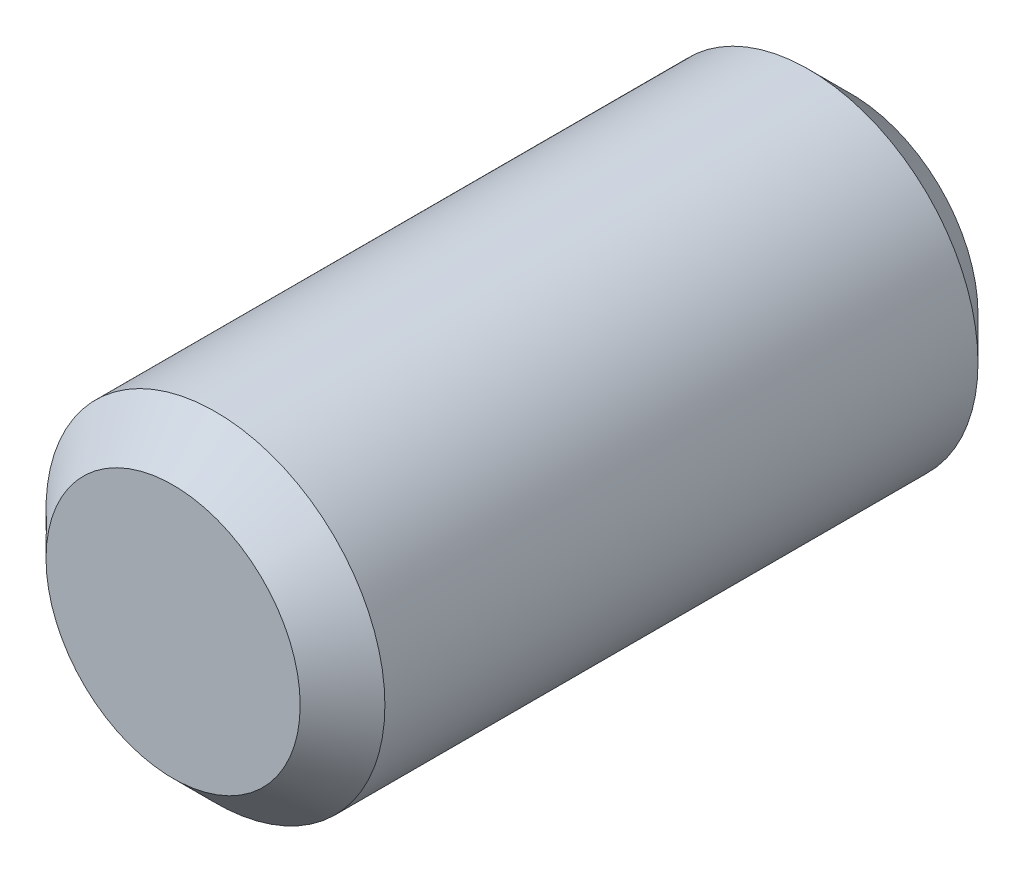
ISO-10303-21;
HEADER;
FILE_DESCRIPTION(('STEP AP214'),'2;1');
FILE_NAME('part.step','',(''),(''),'','','');
FILE_SCHEMA(('AUTOMOTIVE_DESIGN { 1 0 10303 214 1 1 1 1 }'));
ENDSEC;
DATA;
#1=APPLICATION_CONTEXT('core data for automotive mechanical design processes');
#2=APPLICATION_PROTOCOL_DEFINITION('international standard','automotive_design',2000,#1);
#3=PRODUCT_CONTEXT('',#1,'mechanical');
#4=PRODUCT('Part','Part','',(#3));
#5=PRODUCT_RELATED_PRODUCT_CATEGORY('part','',(#4));
#6=PRODUCT_DEFINITION_FORMATION('','',#4);
#7=PRODUCT_DEFINITION_CONTEXT('part definition',#1,'design');
#8=PRODUCT_DEFINITION('design','',#6,#7);
#9=PRODUCT_DEFINITION_SHAPE('','',#8);
#10=(LENGTH_UNIT() NAMED_UNIT(*) SI_UNIT(.MILLI.,.METRE.));
#11=(NAMED_UNIT(*) PLANE_ANGLE_UNIT() SI_UNIT($,.RADIAN.));
#12=(NAMED_UNIT(*) SI_UNIT($,.STERADIAN.) SOLID_ANGLE_UNIT());
#13=UNCERTAINTY_MEASURE_WITH_UNIT(LENGTH_MEASURE(1.E-05),#10,'distance_accuracy_value','');
#14=(GEOMETRIC_REPRESENTATION_CONTEXT(3) GLOBAL_UNCERTAINTY_ASSIGNED_CONTEXT((#13)) GLOBAL_UNIT_ASSIGNED_CONTEXT((#10,
#11,#12)) REPRESENTATION_CONTEXT('',''));
#15=CARTESIAN_POINT('',(0.,0.,0.));
#16=DIRECTION('',(0.,0.,1.));
#17=DIRECTION('',(1.,0.,0.));
#18=AXIS2_PLACEMENT_3D('',#15,#16,#17);
#19=CARTESIAN_POINT('',(0.,0.,4.));
#20=DIRECTION('',(0.,0.,-1.));
#21=DIRECTION('',(-1.,0.,0.));
#22=AXIS2_PLACEMENT_3D('',#19,#20,#21);
#23=CYLINDRICAL_SURFACE('',#22,2.);
#24=CARTESIAN_POINT('',(0.,0.,-3.5));
#25=DIRECTION('',(0.,0.,1.));
#26=DIRECTION('',(1.,0.,0.));
#27=AXIS2_PLACEMENT_3D('',#24,#25,#26);
#28=CIRCLE('',#27,2.);
#29=CARTESIAN_POINT('',(2.,0.,-3.5));
#30=VERTEX_POINT('',#29);
#31=EDGE_CURVE('E44',#30,#30,#28,.T.);
#32=ORIENTED_EDGE('',*,*,#31,.T.);
#33=EDGE_LOOP('',(#32));
#34=FACE_BOUND('',#33,.T.);
#35=CARTESIAN_POINT('',(0.,0.,3.5));
#36=DIRECTION('',(0.,0.,1.));
#37=DIRECTION('',(1.,0.,0.));
#38=AXIS2_PLACEMENT_3D('',#35,#36,#37);
#39=CIRCLE('',#38,2.);
#40=CARTESIAN_POINT('',(2.,0.,3.5));
#41=VERTEX_POINT('',#40);
#42=EDGE_CURVE('E48',#41,#41,#39,.F.);
#43=ORIENTED_EDGE('',*,*,#42,.T.);
#44=EDGE_LOOP('',(#43));
#45=FACE_BOUND('',#44,.T.);
#46=ADVANCED_FACE('F33',(#34,#45),#23,.T.);
#47=CARTESIAN_POINT('',(0.,0.,4.));
#48=DIRECTION('',(0.,0.,1.));
#49=DIRECTION('',(1.,0.,0.));
#50=AXIS2_PLACEMENT_3D('',#47,#48,#49);
#51=PLANE('',#50);
#52=CARTESIAN_POINT('',(0.,0.,4.));
#53=DIRECTION('',(0.,0.,1.));
#54=DIRECTION('',(1.,0.,0.));
#55=AXIS2_PLACEMENT_3D('',#52,#53,#54);
#56=CIRCLE('',#55,1.5);
#57=CARTESIAN_POINT('',(1.5,0.,4.));
#58=VERTEX_POINT('',#57);
#59=EDGE_CURVE('E10',#58,#58,#56,.T.);
#60=ORIENTED_EDGE('',*,*,#59,.T.);
#61=EDGE_LOOP('',(#60));
#62=FACE_BOUND('',#61,.T.);
#63=ADVANCED_FACE('F64',(#62),#51,.T.);
#64=CARTESIAN_POINT('',(0.,0.,-4.));
#65=DIRECTION('',(0.,0.,1.));
#66=DIRECTION('',(1.,0.,0.));
#67=AXIS2_PLACEMENT_3D('',#64,#65,#66);
#68=PLANE('',#67);
#69=CARTESIAN_POINT('',(0.,0.,-4.));
#70=DIRECTION('',(0.,0.,1.));
#71=DIRECTION('',(1.,0.,0.));
#72=AXIS2_PLACEMENT_3D('',#69,#70,#71);
#73=CIRCLE('',#72,1.5);
#74=CARTESIAN_POINT('',(1.5,0.,-4.));
#75=VERTEX_POINT('',#74);
#76=EDGE_CURVE('E40',#75,#75,#73,.F.);
#77=ORIENTED_EDGE('',*,*,#76,.T.);
#78=EDGE_LOOP('',(#77));
#79=FACE_BOUND('',#78,.T.);
#80=ADVANCED_FACE('F61',(#79),#68,.F.);
#81=CARTESIAN_POINT('',(0.,0.,-3.5));
#82=DIRECTION('',(0.,0.,1.));
#83=DIRECTION('',(1.,0.,0.));
#84=AXIS2_PLACEMENT_3D('',#81,#82,#83);
#85=CONICAL_SURFACE('',#84,2.,0.785398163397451);
#86=ORIENTED_EDGE('',*,*,#76,.F.);
#87=EDGE_LOOP('',(#86));
#88=FACE_BOUND('',#87,.T.);
#89=ORIENTED_EDGE('',*,*,#31,.F.);
#90=EDGE_LOOP('',(#89));
#91=FACE_BOUND('',#90,.T.);
#92=ADVANCED_FACE('F57',(#88,#91),#85,.T.);
#93=CARTESIAN_POINT('',(0.,0.,4.));
#94=DIRECTION('',(0.,0.,-1.));
#95=DIRECTION('',(-1.,0.,0.));
#96=AXIS2_PLACEMENT_3D('',#93,#94,#95);
#97=CONICAL_SURFACE('',#96,1.5,0.785398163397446);
#98=ORIENTED_EDGE('',*,*,#42,.F.);
#99=EDGE_LOOP('',(#98));
#100=FACE_BOUND('',#99,.T.);
#101=ORIENTED_EDGE('',*,*,#59,.F.);
#102=EDGE_LOOP('',(#101));
#103=FACE_BOUND('',#102,.T.);
#104=ADVANCED_FACE('F35',(#100,#103),#97,.T.);
#105=CLOSED_SHELL('',(#46,#63,#80,#92,#104));
#106=MANIFOLD_SOLID_BREP('B2',#105);
#107=ADVANCED_BREP_SHAPE_REPRESENTATION('',(#18,#106),#14);
#108=SHAPE_DEFINITION_REPRESENTATION(#9,#107);
ENDSEC;
END-ISO-10303-21;
